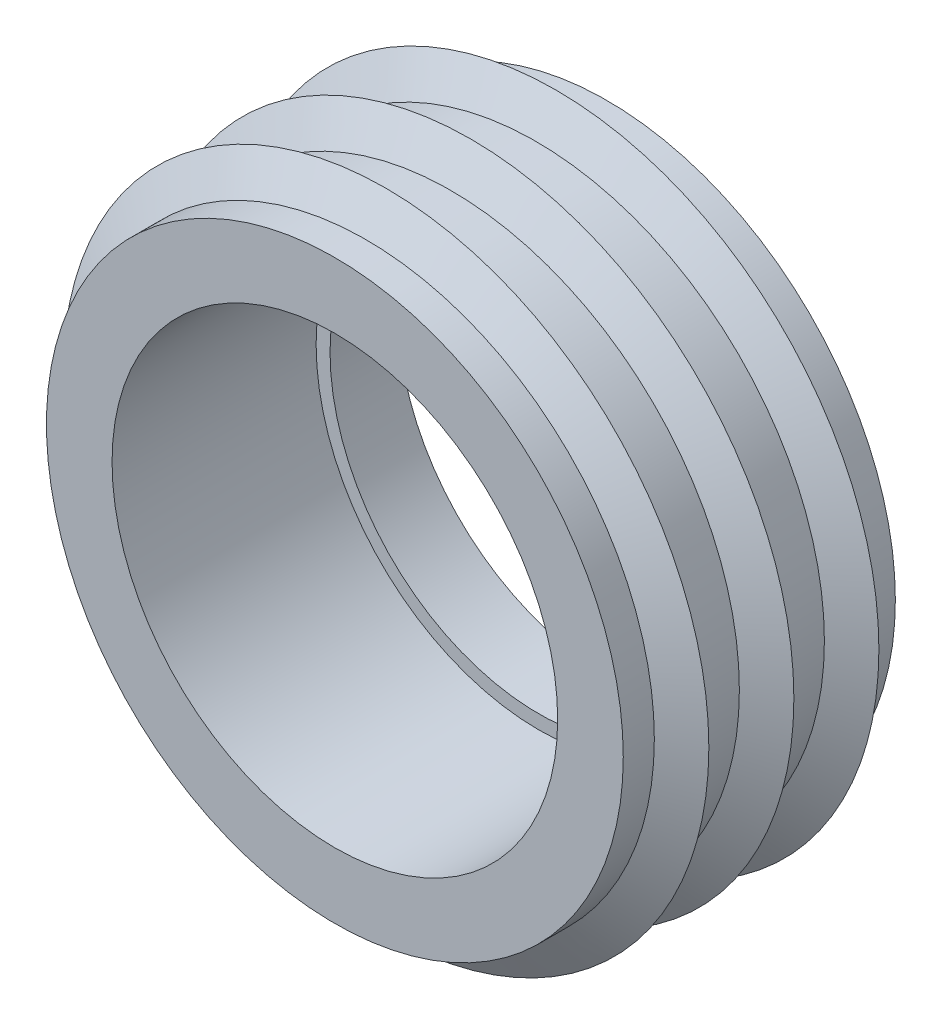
ISO-10303-21;
HEADER;
FILE_DESCRIPTION(('STEP AP214'),'2;1');
FILE_NAME('part.step','',(''),(''),'','','');
FILE_SCHEMA(('AUTOMOTIVE_DESIGN { 1 0 10303 214 1 1 1 1 }'));
ENDSEC;
DATA;
#1=APPLICATION_CONTEXT('core data for automotive mechanical design processes');
#2=APPLICATION_PROTOCOL_DEFINITION('international standard','automotive_design',2000,#1);
#3=PRODUCT_CONTEXT('',#1,'mechanical');
#4=PRODUCT('Part','Part','',(#3));
#5=PRODUCT_RELATED_PRODUCT_CATEGORY('part','',(#4));
#6=PRODUCT_DEFINITION_FORMATION('','',#4);
#7=PRODUCT_DEFINITION_CONTEXT('part definition',#1,'design');
#8=PRODUCT_DEFINITION('design','',#6,#7);
#9=PRODUCT_DEFINITION_SHAPE('','',#8);
#10=(LENGTH_UNIT() NAMED_UNIT(*) SI_UNIT(.MILLI.,.METRE.));
#11=(NAMED_UNIT(*) PLANE_ANGLE_UNIT() SI_UNIT($,.RADIAN.));
#12=(NAMED_UNIT(*) SI_UNIT($,.STERADIAN.) SOLID_ANGLE_UNIT());
#13=UNCERTAINTY_MEASURE_WITH_UNIT(LENGTH_MEASURE(1.E-05),#10,'distance_accuracy_value','');
#14=(GEOMETRIC_REPRESENTATION_CONTEXT(3) GLOBAL_UNCERTAINTY_ASSIGNED_CONTEXT((#13)) GLOBAL_UNIT_ASSIGNED_CONTEXT((#10,
#11,#12)) REPRESENTATION_CONTEXT('',''));
#15=CARTESIAN_POINT('',(0.,0.,0.));
#16=DIRECTION('',(0.,0.,1.));
#17=DIRECTION('',(1.,0.,0.));
#18=AXIS2_PLACEMENT_3D('',#15,#16,#17);
#19=CARTESIAN_POINT('',(10.3886,0.,12.7));
#20=DIRECTION('',(0.,0.,1.));
#21=DIRECTION('',(1.,0.,0.));
#22=AXIS2_PLACEMENT_3D('',#19,#20,#21);
#23=PLANE('',#22);
#24=CARTESIAN_POINT('',(0.,0.,12.7));
#25=DIRECTION('',(0.,0.,1.));
#26=DIRECTION('',(1.,0.,0.));
#27=AXIS2_PLACEMENT_3D('',#24,#25,#26);
#28=CIRCLE('',#27,10.4);
#29=CARTESIAN_POINT('',(10.4,0.,12.7));
#30=VERTEX_POINT('',#29);
#31=EDGE_CURVE('E61',#30,#30,#28,.T.);
#32=ORIENTED_EDGE('',*,*,#31,.F.);
#33=EDGE_LOOP('',(#32));
#34=FACE_BOUND('',#33,.T.);
#35=CARTESIAN_POINT('',(0.,0.,12.7));
#36=DIRECTION('',(0.,0.,1.));
#37=DIRECTION('',(1.,0.,0.));
#38=AXIS2_PLACEMENT_3D('',#35,#36,#37);
#39=CIRCLE('',#38,13.462);
#40=CARTESIAN_POINT('',(13.462,0.,12.7));
#41=VERTEX_POINT('',#40);
#42=EDGE_CURVE('E8',#41,#41,#39,.T.);
#43=ORIENTED_EDGE('',*,*,#42,.T.);
#44=EDGE_LOOP('',(#43));
#45=FACE_BOUND('',#44,.T.);
#46=ADVANCED_FACE('F12',(#34,#45),#23,.T.);
#47=CARTESIAN_POINT('',(0.,0.,12.7));
#48=DIRECTION('',(0.,0.,1.));
#49=DIRECTION('',(1.,0.,0.));
#50=AXIS2_PLACEMENT_3D('',#47,#48,#49);
#51=CYLINDRICAL_SURFACE('',#50,13.462);
#52=ORIENTED_EDGE('',*,*,#42,.F.);
#53=EDGE_LOOP('',(#52));
#54=FACE_BOUND('',#53,.T.);
#55=CARTESIAN_POINT('',(0.,0.,11.2499582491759));
#56=DIRECTION('',(0.,0.,1.));
#57=DIRECTION('',(1.,0.,0.));
#58=AXIS2_PLACEMENT_3D('',#55,#56,#57);
#59=CIRCLE('',#58,13.462);
#60=CARTESIAN_POINT('',(13.462,0.,11.2499582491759));
#61=VERTEX_POINT('',#60);
#62=EDGE_CURVE('E18',#61,#61,#59,.T.);
#63=ORIENTED_EDGE('',*,*,#62,.T.);
#64=EDGE_LOOP('',(#63));
#65=FACE_BOUND('',#64,.T.);
#66=ADVANCED_FACE('F68',(#54,#65),#51,.T.);
#67=CARTESIAN_POINT('',(0.,0.,11.2499582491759));
#68=DIRECTION('',(0.,0.,-1.));
#69=DIRECTION('',(-1.,0.,0.));
#70=AXIS2_PLACEMENT_3D('',#67,#68,#69);
#71=CONICAL_SURFACE('',#70,13.462,1.0471975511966);
#72=CARTESIAN_POINT('',(0.,0.,10.31875));
#73=DIRECTION('',(0.,0.,1.));
#74=DIRECTION('',(1.,0.,0.));
#75=AXIS2_PLACEMENT_3D('',#72,#73,#74);
#76=CIRCLE('',#75,15.0749);
#77=CARTESIAN_POINT('',(15.0749,0.,10.31875));
#78=VERTEX_POINT('',#77);
#79=EDGE_CURVE('E22',#78,#78,#76,.T.);
#80=ORIENTED_EDGE('',*,*,#79,.T.);
#81=EDGE_LOOP('',(#80));
#82=FACE_BOUND('',#81,.T.);
#83=ORIENTED_EDGE('',*,*,#62,.F.);
#84=EDGE_LOOP('',(#83));
#85=FACE_BOUND('',#84,.T.);
#86=ADVANCED_FACE('F73',(#82,#85),#71,.T.);
#87=CARTESIAN_POINT('',(0.,0.,10.31875));
#88=DIRECTION('',(0.,0.,1.));
#89=DIRECTION('',(1.,0.,0.));
#90=AXIS2_PLACEMENT_3D('',#87,#88,#89);
#91=CONICAL_SURFACE('',#90,15.0749,1.0471975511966);
#92=CARTESIAN_POINT('',(0.,0.,9.38754175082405));
#93=DIRECTION('',(0.,0.,1.));
#94=DIRECTION('',(1.,0.,0.));
#95=AXIS2_PLACEMENT_3D('',#92,#93,#94);
#96=CIRCLE('',#95,13.462);
#97=CARTESIAN_POINT('',(13.462,0.,9.38754175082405));
#98=VERTEX_POINT('',#97);
#99=EDGE_CURVE('E26',#98,#98,#96,.T.);
#100=ORIENTED_EDGE('',*,*,#99,.T.);
#101=EDGE_LOOP('',(#100));
#102=FACE_BOUND('',#101,.T.);
#103=ORIENTED_EDGE('',*,*,#79,.F.);
#104=EDGE_LOOP('',(#103));
#105=FACE_BOUND('',#104,.T.);
#106=ADVANCED_FACE('F78',(#102,#105),#91,.T.);
#107=CARTESIAN_POINT('',(0.,0.,12.7));
#108=DIRECTION('',(0.,0.,1.));
#109=DIRECTION('',(1.,0.,0.));
#110=AXIS2_PLACEMENT_3D('',#107,#108,#109);
#111=CYLINDRICAL_SURFACE('',#110,13.462);
#112=CARTESIAN_POINT('',(0.,0.,7.28120824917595));
#113=DIRECTION('',(0.,0.,1.));
#114=DIRECTION('',(1.,0.,0.));
#115=AXIS2_PLACEMENT_3D('',#112,#113,#114);
#116=CIRCLE('',#115,13.462);
#117=CARTESIAN_POINT('',(13.462,0.,7.28120824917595));
#118=VERTEX_POINT('',#117);
#119=EDGE_CURVE('E31',#118,#118,#116,.T.);
#120=ORIENTED_EDGE('',*,*,#119,.T.);
#121=EDGE_LOOP('',(#120));
#122=FACE_BOUND('',#121,.T.);
#123=ORIENTED_EDGE('',*,*,#99,.F.);
#124=EDGE_LOOP('',(#123));
#125=FACE_BOUND('',#124,.T.);
#126=ADVANCED_FACE('F84',(#122,#125),#111,.T.);
#127=CARTESIAN_POINT('',(0.,0.,7.28120824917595));
#128=DIRECTION('',(0.,0.,-1.));
#129=DIRECTION('',(-1.,0.,0.));
#130=AXIS2_PLACEMENT_3D('',#127,#128,#129);
#131=CONICAL_SURFACE('',#130,13.462,1.0471975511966);
#132=CARTESIAN_POINT('',(0.,0.,6.35));
#133=DIRECTION('',(0.,0.,1.));
#134=DIRECTION('',(1.,0.,0.));
#135=AXIS2_PLACEMENT_3D('',#132,#133,#134);
#136=CIRCLE('',#135,15.0749);
#137=CARTESIAN_POINT('',(15.0749,0.,6.35));
#138=VERTEX_POINT('',#137);
#139=EDGE_CURVE('E34',#138,#138,#136,.T.);
#140=ORIENTED_EDGE('',*,*,#139,.T.);
#141=EDGE_LOOP('',(#140));
#142=FACE_BOUND('',#141,.T.);
#143=ORIENTED_EDGE('',*,*,#119,.F.);
#144=EDGE_LOOP('',(#143));
#145=FACE_BOUND('',#144,.T.);
#146=ADVANCED_FACE('F88',(#142,#145),#131,.T.);
#147=CARTESIAN_POINT('',(0.,0.,6.35));
#148=DIRECTION('',(0.,0.,1.));
#149=DIRECTION('',(1.,0.,0.));
#150=AXIS2_PLACEMENT_3D('',#147,#148,#149);
#151=CONICAL_SURFACE('',#150,15.0749,1.0471975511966);
#152=CARTESIAN_POINT('',(0.,0.,5.41879175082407));
#153=DIRECTION('',(0.,0.,1.));
#154=DIRECTION('',(1.,0.,0.));
#155=AXIS2_PLACEMENT_3D('',#152,#153,#154);
#156=CIRCLE('',#155,13.462);
#157=CARTESIAN_POINT('',(13.462,0.,5.41879175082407));
#158=VERTEX_POINT('',#157);
#159=EDGE_CURVE('E37',#158,#158,#156,.T.);
#160=ORIENTED_EDGE('',*,*,#159,.T.);
#161=EDGE_LOOP('',(#160));
#162=FACE_BOUND('',#161,.T.);
#163=ORIENTED_EDGE('',*,*,#139,.F.);
#164=EDGE_LOOP('',(#163));
#165=FACE_BOUND('',#164,.T.);
#166=ADVANCED_FACE('F92',(#162,#165),#151,.T.);
#167=CARTESIAN_POINT('',(0.,0.,12.7));
#168=DIRECTION('',(0.,0.,1.));
#169=DIRECTION('',(1.,0.,0.));
#170=AXIS2_PLACEMENT_3D('',#167,#168,#169);
#171=CYLINDRICAL_SURFACE('',#170,13.462);
#172=CARTESIAN_POINT('',(0.,0.,3.31245824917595));
#173=DIRECTION('',(0.,0.,1.));
#174=DIRECTION('',(1.,0.,0.));
#175=AXIS2_PLACEMENT_3D('',#172,#173,#174);
#176=CIRCLE('',#175,13.462);
#177=CARTESIAN_POINT('',(13.462,0.,3.31245824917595));
#178=VERTEX_POINT('',#177);
#179=EDGE_CURVE('E40',#178,#178,#176,.T.);
#180=ORIENTED_EDGE('',*,*,#179,.T.);
#181=EDGE_LOOP('',(#180));
#182=FACE_BOUND('',#181,.T.);
#183=ORIENTED_EDGE('',*,*,#159,.F.);
#184=EDGE_LOOP('',(#183));
#185=FACE_BOUND('',#184,.T.);
#186=ADVANCED_FACE('F96',(#182,#185),#171,.T.);
#187=CARTESIAN_POINT('',(0.,0.,3.31245824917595));
#188=DIRECTION('',(0.,0.,-1.));
#189=DIRECTION('',(-1.,0.,0.));
#190=AXIS2_PLACEMENT_3D('',#187,#188,#189);
#191=CONICAL_SURFACE('',#190,13.462,1.0471975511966);
#192=CARTESIAN_POINT('',(0.,0.,2.38125));
#193=DIRECTION('',(0.,0.,1.));
#194=DIRECTION('',(1.,0.,0.));
#195=AXIS2_PLACEMENT_3D('',#192,#193,#194);
#196=CIRCLE('',#195,15.0749);
#197=CARTESIAN_POINT('',(15.0749,0.,2.38125));
#198=VERTEX_POINT('',#197);
#199=EDGE_CURVE('E43',#198,#198,#196,.T.);
#200=ORIENTED_EDGE('',*,*,#199,.T.);
#201=EDGE_LOOP('',(#200));
#202=FACE_BOUND('',#201,.T.);
#203=ORIENTED_EDGE('',*,*,#179,.F.);
#204=EDGE_LOOP('',(#203));
#205=FACE_BOUND('',#204,.T.);
#206=ADVANCED_FACE('F100',(#202,#205),#191,.T.);
#207=CARTESIAN_POINT('',(0.,0.,2.38125));
#208=DIRECTION('',(0.,0.,1.));
#209=DIRECTION('',(1.,0.,0.));
#210=AXIS2_PLACEMENT_3D('',#207,#208,#209);
#211=CONICAL_SURFACE('',#210,15.0749,1.0471975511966);
#212=CARTESIAN_POINT('',(0.,0.,1.45004175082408));
#213=DIRECTION('',(0.,0.,1.));
#214=DIRECTION('',(1.,0.,0.));
#215=AXIS2_PLACEMENT_3D('',#212,#213,#214);
#216=CIRCLE('',#215,13.462);
#217=CARTESIAN_POINT('',(13.462,0.,1.45004175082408));
#218=VERTEX_POINT('',#217);
#219=EDGE_CURVE('E46',#218,#218,#216,.T.);
#220=ORIENTED_EDGE('',*,*,#219,.T.);
#221=EDGE_LOOP('',(#220));
#222=FACE_BOUND('',#221,.T.);
#223=ORIENTED_EDGE('',*,*,#199,.F.);
#224=EDGE_LOOP('',(#223));
#225=FACE_BOUND('',#224,.T.);
#226=ADVANCED_FACE('F104',(#222,#225),#211,.T.);
#227=CARTESIAN_POINT('',(0.,0.,12.7));
#228=DIRECTION('',(0.,0.,1.));
#229=DIRECTION('',(1.,0.,0.));
#230=AXIS2_PLACEMENT_3D('',#227,#228,#229);
#231=CYLINDRICAL_SURFACE('',#230,13.462);
#232=CARTESIAN_POINT('',(0.,0.,0.));
#233=DIRECTION('',(0.,0.,1.));
#234=DIRECTION('',(1.,0.,0.));
#235=AXIS2_PLACEMENT_3D('',#232,#233,#234);
#236=CIRCLE('',#235,13.462);
#237=CARTESIAN_POINT('',(13.462,0.,0.));
#238=VERTEX_POINT('',#237);
#239=EDGE_CURVE('E49',#238,#238,#236,.T.);
#240=ORIENTED_EDGE('',*,*,#239,.T.);
#241=EDGE_LOOP('',(#240));
#242=FACE_BOUND('',#241,.T.);
#243=ORIENTED_EDGE('',*,*,#219,.F.);
#244=EDGE_LOOP('',(#243));
#245=FACE_BOUND('',#244,.T.);
#246=ADVANCED_FACE('F108',(#242,#245),#231,.T.);
#247=CARTESIAN_POINT('',(13.462,0.,0.));
#248=DIRECTION('',(0.,0.,-1.));
#249=DIRECTION('',(-1.,0.,0.));
#250=AXIS2_PLACEMENT_3D('',#247,#248,#249);
#251=PLANE('',#250);
#252=ORIENTED_EDGE('',*,*,#239,.F.);
#253=EDGE_LOOP('',(#252));
#254=FACE_BOUND('',#253,.T.);
#255=CARTESIAN_POINT('',(0.,0.,0.));
#256=DIRECTION('',(0.,0.,-1.));
#257=DIRECTION('',(-1.,0.,0.));
#258=AXIS2_PLACEMENT_3D('',#255,#256,#257);
#259=CIRCLE('',#258,9.75);
#260=CARTESIAN_POINT('',(-9.75,0.,0.));
#261=VERTEX_POINT('',#260);
#262=EDGE_CURVE('E52',#261,#261,#259,.F.);
#263=ORIENTED_EDGE('',*,*,#262,.T.);
#264=EDGE_LOOP('',(#263));
#265=FACE_BOUND('',#264,.T.);
#266=ADVANCED_FACE('F112',(#254,#265),#251,.T.);
#267=CARTESIAN_POINT('',(9.9695,0.,3.175));
#268=DIRECTION('',(0.,0.,1.));
#269=DIRECTION('',(1.,0.,0.));
#270=AXIS2_PLACEMENT_3D('',#267,#268,#269);
#271=PLANE('',#270);
#272=CARTESIAN_POINT('',(0.,0.,3.175));
#273=DIRECTION('',(0.,0.,1.));
#274=DIRECTION('',(1.,0.,0.));
#275=AXIS2_PLACEMENT_3D('',#272,#273,#274);
#276=CIRCLE('',#275,9.75);
#277=CARTESIAN_POINT('',(9.75,0.,3.175));
#278=VERTEX_POINT('',#277);
#279=EDGE_CURVE('E55',#278,#278,#276,.T.);
#280=ORIENTED_EDGE('',*,*,#279,.F.);
#281=EDGE_LOOP('',(#280));
#282=FACE_BOUND('',#281,.T.);
#283=CARTESIAN_POINT('',(0.,0.,3.175));
#284=DIRECTION('',(0.,0.,1.));
#285=DIRECTION('',(1.,0.,0.));
#286=AXIS2_PLACEMENT_3D('',#283,#284,#285);
#287=CIRCLE('',#286,10.4);
#288=CARTESIAN_POINT('',(10.4,0.,3.175));
#289=VERTEX_POINT('',#288);
#290=EDGE_CURVE('E58',#289,#289,#287,.F.);
#291=ORIENTED_EDGE('',*,*,#290,.F.);
#292=EDGE_LOOP('',(#291));
#293=FACE_BOUND('',#292,.T.);
#294=ADVANCED_FACE('F116',(#282,#293),#271,.T.);
#295=CARTESIAN_POINT('',(0.,0.,-29.3833980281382));
#296=DIRECTION('',(0.,0.,1.));
#297=DIRECTION('',(1.,0.,0.));
#298=AXIS2_PLACEMENT_3D('',#295,#296,#297);
#299=CYLINDRICAL_SURFACE('',#298,9.75);
#300=ORIENTED_EDGE('',*,*,#279,.T.);
#301=EDGE_LOOP('',(#300));
#302=FACE_BOUND('',#301,.T.);
#303=ORIENTED_EDGE('',*,*,#262,.F.);
#304=EDGE_LOOP('',(#303));
#305=FACE_BOUND('',#304,.T.);
#306=ADVANCED_FACE('F120',(#302,#305),#299,.F.);
#307=CARTESIAN_POINT('',(0.,0.,-26.2406420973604));
#308=DIRECTION('',(0.,0.,1.));
#309=DIRECTION('',(1.,0.,0.));
#310=AXIS2_PLACEMENT_3D('',#307,#308,#309);
#311=CYLINDRICAL_SURFACE('',#310,10.4);
#312=ORIENTED_EDGE('',*,*,#290,.T.);
#313=EDGE_LOOP('',(#312));
#314=FACE_BOUND('',#313,.T.);
#315=ORIENTED_EDGE('',*,*,#31,.T.);
#316=EDGE_LOOP('',(#315));
#317=FACE_BOUND('',#316,.T.);
#318=ADVANCED_FACE('F65',(#314,#317),#311,.F.);
#319=CLOSED_SHELL('',(#46,#66,#86,#106,#126,#146,#166,#186,#206,#226,#246,#266,#294,#306,#318));
#320=MANIFOLD_SOLID_BREP('B1',#319);
#321=ADVANCED_BREP_SHAPE_REPRESENTATION('',(#18,#320),#14);
#322=SHAPE_DEFINITION_REPRESENTATION(#9,#321);
ENDSEC;
END-ISO-10303-21;
